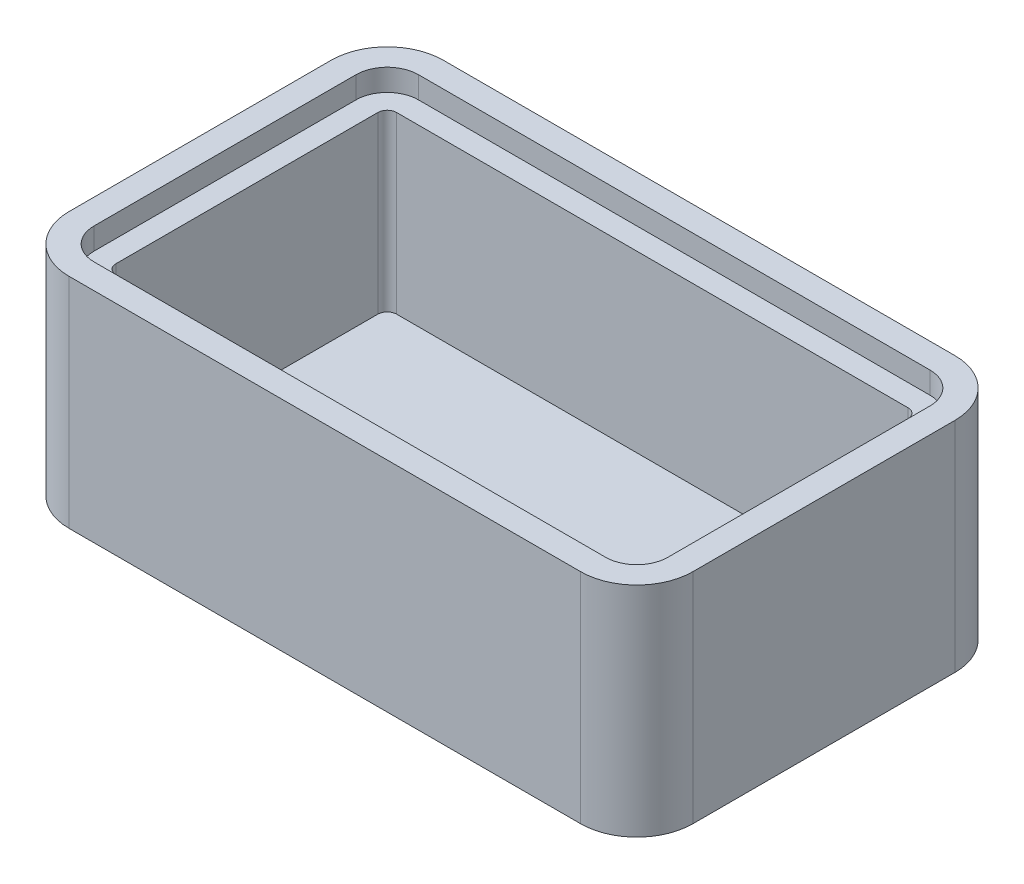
from build123d import *

# Parameters (mm, degrees)
SKETCH1_W          = 127
SKETCH1_H          = 76.2
EXTRUDE1_DEPTH     = 44.45
FILLET1_R          = 11.43
CUT_EXTRUDE1_DEPTH = 4.445
CUT_EXTRUDE2_DEPTH = 35.56


with BuildPart() as part:
    # Sketch1 → Extrude1 (new body)
    with BuildSketch(Plane(origin=(0, 0, 0), x_dir=(1, 0, 0), z_dir=(0, 1, 0))):
        with Locations((63.5, 38.1)):
            Rectangle(SKETCH1_W, SKETCH1_H)
    extrude(amount=EXTRUDE1_DEPTH)

    # Fillet1
    fillet1_edges = [part.edges().sort_by_distance(p)[0] for p in [
        (0, 22.225, -76.2),
        (127, 22.225, -76.2),
        (127, 22.225, 0),
        (0, 22.225, 0),
    ]]
    fillet(fillet1_edges, radius=FILLET1_R)

    # Sketch2 → Cut-Extrude1 (cut)
    with BuildSketch(Plane(origin=(0, 44.45, 0), x_dir=(-1, 0, 0), z_dir=(0, 1, 0))):
        with BuildLine():
            Line((-121.92, -11.43), (-121.92, -64.77))
            ThreePointArc((-121.92, -64.77), (-120.060128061, -69.260128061), (-115.57, -71.12))
            Line((-115.57, -71.12), (-11.43, -71.12))
            ThreePointArc((-11.43, -71.12), (-6.939871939, -69.260128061), (-5.08, -64.77))
            Line((-5.08, -64.77), (-5.08, -11.43))
            ThreePointArc((-5.08, -11.43), (-6.939871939, -6.939871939), (-11.43, -5.08))
            Line((-11.43, -5.08), (-115.57, -5.08))
            ThreePointArc((-115.57, -5.08), (-120.060128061, -6.939871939), (-121.92, -11.43))
        make_face()
    extrude(amount=-CUT_EXTRUDE1_DEPTH, mode=Mode.SUBTRACT)

    # Sketch3 → Cut-Extrude2 (cut)
    with BuildSketch(Plane(origin=(0, 40.005, 0), x_dir=(-1, 0, 0), z_dir=(0, 1, 0))):
        with BuildLine():
            Line((-117.475, -11.43), (-117.475, -64.77))
            ThreePointArc((-117.475, -64.77), (-116.917038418, -66.117038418), (-115.57, -66.675))
            Line((-115.57, -66.675), (-11.43, -66.675))
            ThreePointArc((-11.43, -66.675), (-10.082961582, -66.117038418), (-9.525, -64.77))
            Line((-9.525, -64.77), (-9.525, -11.43))
            ThreePointArc((-9.525, -11.43), (-10.082961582, -10.082961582), (-11.43, -9.525))
            Line((-11.43, -9.525), (-115.57, -9.525))
            ThreePointArc((-115.57, -9.525), (-116.917038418, -10.082961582), (-117.475, -11.43))
        make_face()
    extrude(amount=-CUT_EXTRUDE2_DEPTH, mode=Mode.SUBTRACT)


solid = part.part
